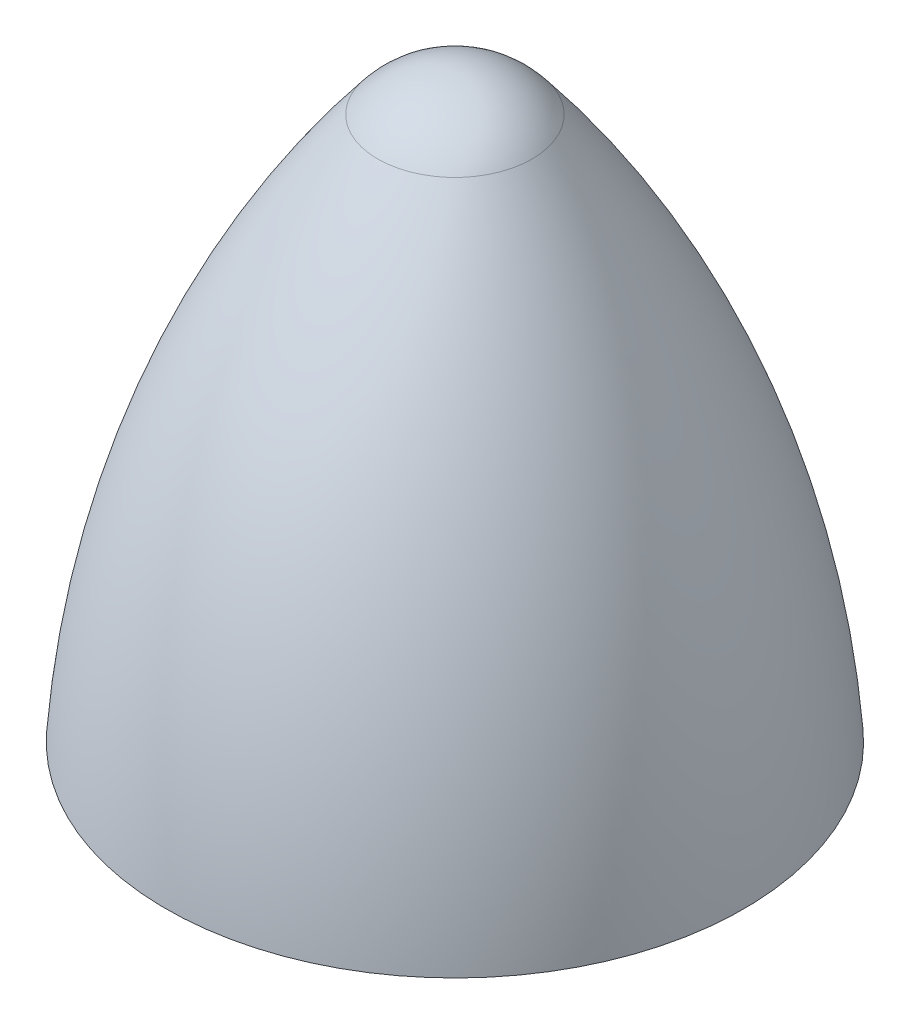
ISO-10303-21;
HEADER;
FILE_DESCRIPTION(('STEP AP214'),'2;1');
FILE_NAME('part.step','',(''),(''),'','','');
FILE_SCHEMA(('AUTOMOTIVE_DESIGN { 1 0 10303 214 1 1 1 1 }'));
ENDSEC;
DATA;
#1=APPLICATION_CONTEXT('core data for automotive mechanical design processes');
#2=APPLICATION_PROTOCOL_DEFINITION('international standard','automotive_design',2000,#1);
#3=PRODUCT_CONTEXT('',#1,'mechanical');
#4=PRODUCT('Part','Part','',(#3));
#5=PRODUCT_RELATED_PRODUCT_CATEGORY('part','',(#4));
#6=PRODUCT_DEFINITION_FORMATION('','',#4);
#7=PRODUCT_DEFINITION_CONTEXT('part definition',#1,'design');
#8=PRODUCT_DEFINITION('design','',#6,#7);
#9=PRODUCT_DEFINITION_SHAPE('','',#8);
#10=(LENGTH_UNIT() NAMED_UNIT(*) SI_UNIT(.MILLI.,.METRE.));
#11=(NAMED_UNIT(*) PLANE_ANGLE_UNIT() SI_UNIT($,.RADIAN.));
#12=(NAMED_UNIT(*) SI_UNIT($,.STERADIAN.) SOLID_ANGLE_UNIT());
#13=UNCERTAINTY_MEASURE_WITH_UNIT(LENGTH_MEASURE(1.E-05),#10,'distance_accuracy_value','');
#14=(GEOMETRIC_REPRESENTATION_CONTEXT(3) GLOBAL_UNCERTAINTY_ASSIGNED_CONTEXT((#13)) GLOBAL_UNIT_ASSIGNED_CONTEXT((#10,
#11,#12)) REPRESENTATION_CONTEXT('',''));
#15=CARTESIAN_POINT('',(0.,0.,0.));
#16=DIRECTION('',(0.,0.,1.));
#17=DIRECTION('',(1.,0.,0.));
#18=AXIS2_PLACEMENT_3D('',#15,#16,#17);
#19=CARTESIAN_POINT('',(0.,-2.51038580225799,0.));
#20=DIRECTION('',(0.,1.,0.));
#21=DIRECTION('',(-1.,0.,0.));
#22=AXIS2_PLACEMENT_3D('',#19,#20,#21);
#23=DEGENERATE_TOROIDAL_SURFACE('',#22,25.1464520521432,35.7347391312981,.F.);
#24=CARTESIAN_POINT('',(0.,19.7509586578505,0.));
#25=DIRECTION('',(0.,1.,0.));
#26=DIRECTION('',(-1.,0.,0.));
#27=AXIS2_PLACEMENT_3D('',#24,#25,#26);
#28=CIRCLE('',#27,2.80715457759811);
#29=CARTESIAN_POINT('',(-2.80715457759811,19.7509586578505,0.));
#30=VERTEX_POINT('',#29);
#31=EDGE_CURVE('E10',#30,#30,#28,.T.);
#32=ORIENTED_EDGE('',*,*,#31,.F.);
#33=EDGE_LOOP('',(#32));
#34=FACE_BOUND('',#33,.T.);
#35=CARTESIAN_POINT('',(0.,0.,0.));
#36=DIRECTION('',(0.,1.,0.));
#37=DIRECTION('',(-1.,0.,0.));
#38=AXIS2_PLACEMENT_3D('',#35,#36,#37);
#39=CIRCLE('',#38,10.5);
#40=CARTESIAN_POINT('',(-10.5,0.,0.));
#41=VERTEX_POINT('',#40);
#42=EDGE_CURVE('E30',#41,#41,#39,.T.);
#43=ORIENTED_EDGE('',*,*,#42,.T.);
#44=EDGE_LOOP('',(#43));
#45=FACE_BOUND('',#44,.T.);
#46=ADVANCED_FACE('F24',(#34,#45),#23,.F.);
#47=CARTESIAN_POINT('',(0.,17.5154319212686,0.));
#48=DIRECTION('',(0.,1.,0.));
#49=DIRECTION('',(1.,0.,0.));
#50=AXIS2_PLACEMENT_3D('',#47,#48,#49);
#51=SPHERICAL_SURFACE('',#50,3.58855076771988);
#52=ORIENTED_EDGE('',*,*,#31,.T.);
#53=EDGE_LOOP('',(#52));
#54=FACE_BOUND('',#53,.T.);
#55=ADVANCED_FACE('F39',(#54),#51,.T.);
#56=CARTESIAN_POINT('',(0.,0.,0.));
#57=DIRECTION('',(0.,1.,0.));
#58=DIRECTION('',(-1.,0.,0.));
#59=AXIS2_PLACEMENT_3D('',#56,#57,#58);
#60=PLANE('',#59);
#61=ORIENTED_EDGE('',*,*,#42,.F.);
#62=EDGE_LOOP('',(#61));
#63=FACE_BOUND('',#62,.T.);
#64=ADVANCED_FACE('F37',(#63),#60,.F.);
#65=CLOSED_SHELL('',(#46,#55,#64));
#66=MANIFOLD_SOLID_BREP('B2',#65);
#67=ADVANCED_BREP_SHAPE_REPRESENTATION('',(#18,#66),#14);
#68=SHAPE_DEFINITION_REPRESENTATION(#9,#67);
ENDSEC;
END-ISO-10303-21;
